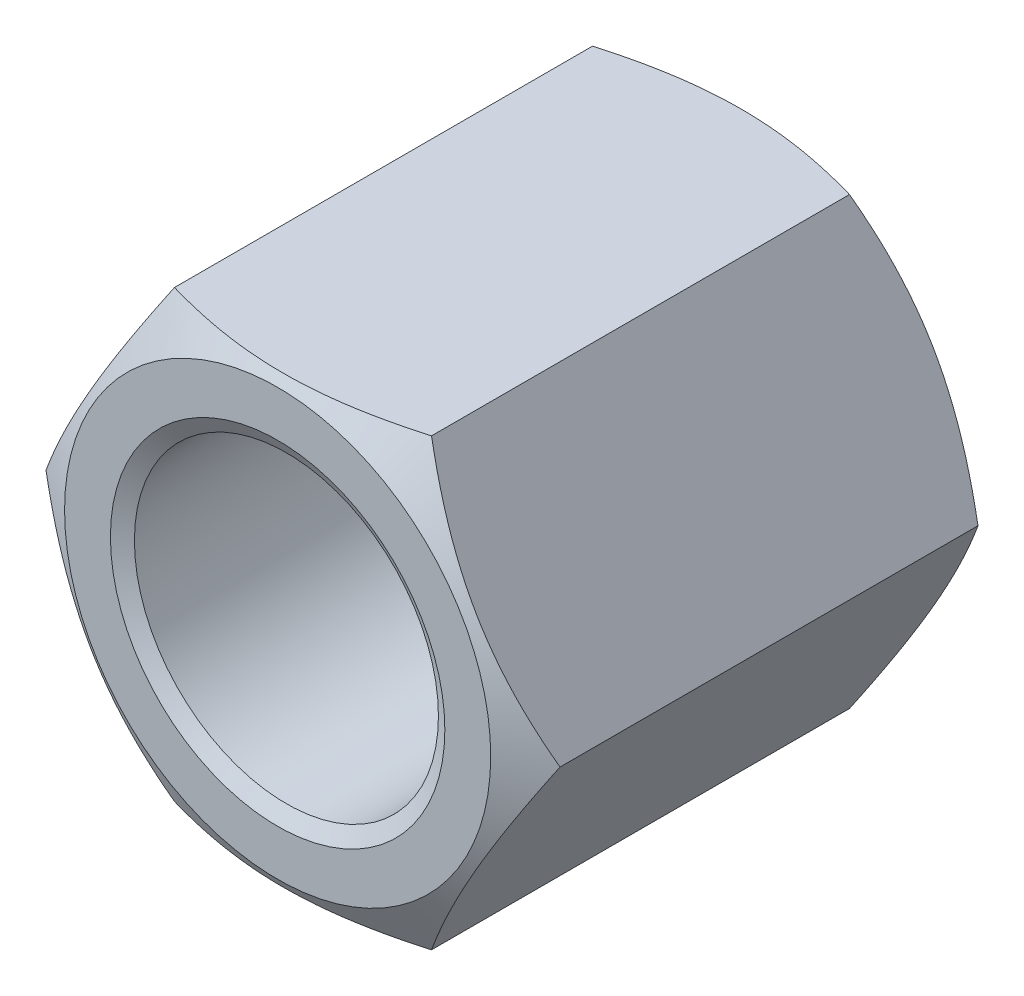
ISO-10303-21;
HEADER;
FILE_DESCRIPTION(('STEP AP214'),'2;1');
FILE_NAME('part.step','',(''),(''),'','','');
FILE_SCHEMA(('AUTOMOTIVE_DESIGN { 1 0 10303 214 1 1 1 1 }'));
ENDSEC;
DATA;
#1=APPLICATION_CONTEXT('core data for automotive mechanical design processes');
#2=APPLICATION_PROTOCOL_DEFINITION('international standard','automotive_design',2000,#1);
#3=PRODUCT_CONTEXT('',#1,'mechanical');
#4=PRODUCT('Part','Part','',(#3));
#5=PRODUCT_RELATED_PRODUCT_CATEGORY('part','',(#4));
#6=PRODUCT_DEFINITION_FORMATION('','',#4);
#7=PRODUCT_DEFINITION_CONTEXT('part definition',#1,'design');
#8=PRODUCT_DEFINITION('design','',#6,#7);
#9=PRODUCT_DEFINITION_SHAPE('','',#8);
#10=(LENGTH_UNIT() NAMED_UNIT(*) SI_UNIT(.MILLI.,.METRE.));
#11=(NAMED_UNIT(*) PLANE_ANGLE_UNIT() SI_UNIT($,.RADIAN.));
#12=(NAMED_UNIT(*) SI_UNIT($,.STERADIAN.) SOLID_ANGLE_UNIT());
#13=UNCERTAINTY_MEASURE_WITH_UNIT(LENGTH_MEASURE(1.E-05),#10,'distance_accuracy_value','');
#14=(GEOMETRIC_REPRESENTATION_CONTEXT(3) GLOBAL_UNCERTAINTY_ASSIGNED_CONTEXT((#13)) GLOBAL_UNIT_ASSIGNED_CONTEXT((#10,
#11,#12)) REPRESENTATION_CONTEXT('',''));
#15=CARTESIAN_POINT('',(0.,0.,0.));
#16=DIRECTION('',(0.,0.,1.));
#17=DIRECTION('',(1.,0.,0.));
#18=AXIS2_PLACEMENT_3D('',#15,#16,#17);
#19=CARTESIAN_POINT('',(-5.07202211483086,-8.785,-18.5));
#20=DIRECTION('',(0.,-1.,0.));
#21=DIRECTION('',(0.,0.,-1.));
#22=AXIS2_PLACEMENT_3D('',#19,#20,#21);
#23=PLANE('',#22);
#24=CARTESIAN_POINT('',(-13.4217436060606,-8.785,-4.40586329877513));
#25=CARTESIAN_POINT('',(-13.2290115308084,-8.785,-4.31276176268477));
#26=CARTESIAN_POINT('',(-13.0360456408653,-8.785,-4.22014448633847));
#27=CARTESIAN_POINT('',(-12.64959683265,-8.785,-4.03598968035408));
#28=CARTESIAN_POINT('',(-12.4561139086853,-8.785,-3.94445216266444));
#29=CARTESIAN_POINT('',(-11.8747583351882,-8.785,-3.67159933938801));
#30=CARTESIAN_POINT('',(-11.4860420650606,-8.785,-3.49207437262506));
#31=CARTESIAN_POINT('',(-10.7036733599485,-8.785,-3.13793005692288));
#32=CARTESIAN_POINT('',(-10.3100053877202,-8.785,-2.96334494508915));
#33=CARTESIAN_POINT('',(-9.51942340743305,-8.785,-2.62171394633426));
#34=CARTESIAN_POINT('',(-9.12250957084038,-8.785,-2.45466766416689));
#35=CARTESIAN_POINT('',(-8.32001606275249,-8.785,-2.12819913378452));
#36=CARTESIAN_POINT('',(-7.91438949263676,-8.785,-1.96889152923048));
#37=CARTESIAN_POINT('',(-7.09834245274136,-8.785,-1.66282803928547));
#38=CARTESIAN_POINT('',(-6.68792145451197,-8.785,-1.51607355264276));
#39=CARTESIAN_POINT('',(-5.86248050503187,-8.785,-1.23908237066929));
#40=CARTESIAN_POINT('',(-5.44747255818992,-8.785,-1.10881029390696));
#41=CARTESIAN_POINT('',(-4.6115731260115,-8.785,-0.86903180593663));
#42=CARTESIAN_POINT('',(-4.19068355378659,-8.785,-0.759518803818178));
#43=CARTESIAN_POINT('',(-3.34265100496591,-8.785,-0.566599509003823));
#44=CARTESIAN_POINT('',(-2.91550602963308,-8.785,-0.483201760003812));
#45=CARTESIAN_POINT('',(-2.27105589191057,-8.785,-0.38188465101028));
#46=CARTESIAN_POINT('',(-2.05559071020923,-8.785,-0.352073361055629));
#47=CARTESIAN_POINT('',(-1.62365980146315,-8.785,-0.300964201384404));
#48=CARTESIAN_POINT('',(-1.40719417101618,-8.785,-0.279665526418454));
#49=CARTESIAN_POINT('',(-0.97491183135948,-8.785,-0.246153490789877));
#50=CARTESIAN_POINT('',(-0.759099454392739,-8.785,-0.233884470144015));
#51=CARTESIAN_POINT('',(-0.327149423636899,-8.785,-0.218496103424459));
#52=CARTESIAN_POINT('',(-0.111011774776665,-8.785,-0.215376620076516));
#53=CARTESIAN_POINT('',(0.321140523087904,-8.785,-0.218361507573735));
#54=CARTESIAN_POINT('',(0.537155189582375,-8.785,-0.224463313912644));
#55=CARTESIAN_POINT('',(0.968740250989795,-8.785,-0.24573987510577));
#56=CARTESIAN_POINT('',(1.18431062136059,-8.785,-0.260915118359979));
#57=CARTESIAN_POINT('',(1.70759461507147,-8.785,-0.308449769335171));
#58=CARTESIAN_POINT('',(2.01489925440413,-8.785,-0.34539998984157));
#59=CARTESIAN_POINT('',(2.62708091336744,-8.785,-0.43567471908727));
#60=CARTESIAN_POINT('',(2.93195756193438,-8.785,-0.489001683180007));
#61=CARTESIAN_POINT('',(3.84348737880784,-8.785,-0.67087087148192));
#62=CARTESIAN_POINT('',(4.44584697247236,-8.785,-0.821179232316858));
#63=CARTESIAN_POINT('',(5.34681739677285,-8.785,-1.08010289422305));
#64=CARTESIAN_POINT('',(5.65014196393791,-8.785,-1.17324449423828));
#65=CARTESIAN_POINT('',(6.25386087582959,-8.785,-1.36875331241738));
#66=CARTESIAN_POINT('',(6.55425495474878,-8.785,-1.4711213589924));
#67=CARTESIAN_POINT('',(7.150613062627,-8.785,-1.68289416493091));
#68=CARTESIAN_POINT('',(7.44659253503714,-8.785,-1.79225587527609));
#69=CARTESIAN_POINT('',(8.03603672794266,-8.785,-2.01727358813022));
#70=CARTESIAN_POINT('',(8.32950228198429,-8.785,-2.13292740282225));
#71=CARTESIAN_POINT('',(8.62191001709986,-8.785,-2.2511373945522));
#72=B_SPLINE_CURVE_WITH_KNOTS('',3,(#24,#25,#26,#27,#28,#29,#30,#31,#32,#33,#34,#35,#36,#37,#38,
#39,#40,#41,#42,#43,#44,#45,#46,#47,#48,#49,#50,#51,#52,#53,#54,#55,#56,#57,#58,#59,#60,#61,#62,
#63,#64,#65,#66,#67,#68,#69,#70,#71),.UNSPECIFIED.,.F.,.F.,(4,2,2,2,2,2,2,2,2,2,2,2,2,2,2,2,2,2,
2,2,2,2,2,4),(0.,0.642121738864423,1.28425057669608,2.56871885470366,3.86059018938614,
5.15239371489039,6.45959889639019,7.76694954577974,9.07144440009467,10.3755243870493,
11.680030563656,12.3324419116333,12.9847915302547,13.6330855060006,14.2813697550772,
14.9294737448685,15.5776126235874,16.5056390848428,17.4338047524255,19.293719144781,
20.2455547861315,21.1974759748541,22.1440160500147,23.0902290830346),.UNSPECIFIED.);
#73=CARTESIAN_POINT('',(-5.07202211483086,-8.785,-1.0011509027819));
#74=VERTEX_POINT('',#73);
#75=CARTESIAN_POINT('',(5.07202211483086,-8.785,-1.0011509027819));
#76=VERTEX_POINT('',#75);
#77=EDGE_CURVE('E50',#74,#76,#72,.T.);
#78=ORIENTED_EDGE('',*,*,#77,.F.);
#79=DIRECTION('',(0.,0.,1.));
#80=VECTOR('',#79,1.);
#81=CARTESIAN_POINT('',(-5.07202211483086,-8.785,-18.5));
#82=LINE('',#81,#80);
#83=CARTESIAN_POINT('',(-5.07202211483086,-8.785,-17.4988490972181));
#84=VERTEX_POINT('',#83);
#85=EDGE_CURVE('E105',#84,#74,#82,.T.);
#86=ORIENTED_EDGE('',*,*,#85,.F.);
#87=CARTESIAN_POINT('',(-13.4217436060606,-8.785,-14.0941367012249));
#88=CARTESIAN_POINT('',(-13.2290115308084,-8.785,-14.1872382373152));
#89=CARTESIAN_POINT('',(-13.0360456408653,-8.785,-14.2798555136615));
#90=CARTESIAN_POINT('',(-12.64959683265,-8.785,-14.4640103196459));
#91=CARTESIAN_POINT('',(-12.4561139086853,-8.785,-14.5555478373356));
#92=CARTESIAN_POINT('',(-11.8747583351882,-8.785,-14.828400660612));
#93=CARTESIAN_POINT('',(-11.4860420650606,-8.785,-15.0079256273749));
#94=CARTESIAN_POINT('',(-10.7036733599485,-8.785,-15.3620699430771));
#95=CARTESIAN_POINT('',(-10.3100053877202,-8.785,-15.5366550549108));
#96=CARTESIAN_POINT('',(-9.51942340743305,-8.785,-15.8782860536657));
#97=CARTESIAN_POINT('',(-9.12250957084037,-8.785,-16.0453323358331));
#98=CARTESIAN_POINT('',(-8.32001606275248,-8.785,-16.3718008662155));
#99=CARTESIAN_POINT('',(-7.91438949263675,-8.785,-16.5311084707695));
#100=CARTESIAN_POINT('',(-7.09834245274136,-8.785,-16.8371719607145));
#101=CARTESIAN_POINT('',(-6.68792145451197,-8.785,-16.9839264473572));
#102=CARTESIAN_POINT('',(-5.86248050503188,-8.785,-17.2609176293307));
#103=CARTESIAN_POINT('',(-5.44747255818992,-8.785,-17.391189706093));
#104=CARTESIAN_POINT('',(-4.6115731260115,-8.785,-17.6309681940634));
#105=CARTESIAN_POINT('',(-4.19068355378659,-8.785,-17.7404811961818));
#106=CARTESIAN_POINT('',(-3.34265100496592,-8.785,-17.9334004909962));
#107=CARTESIAN_POINT('',(-2.91550602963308,-8.785,-18.0167982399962));
#108=CARTESIAN_POINT('',(-2.27105589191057,-8.785,-18.1181153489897));
#109=CARTESIAN_POINT('',(-2.05559071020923,-8.785,-18.1479266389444));
#110=CARTESIAN_POINT('',(-1.62365980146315,-8.785,-18.1990357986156));
#111=CARTESIAN_POINT('',(-1.40719417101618,-8.785,-18.2203344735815));
#112=CARTESIAN_POINT('',(-0.97491183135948,-8.785,-18.2538465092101));
#113=CARTESIAN_POINT('',(-0.759099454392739,-8.785,-18.266115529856));
#114=CARTESIAN_POINT('',(-0.327149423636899,-8.785,-18.2815038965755));
#115=CARTESIAN_POINT('',(-0.111011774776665,-8.785,-18.2846233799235));
#116=CARTESIAN_POINT('',(0.321140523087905,-8.785,-18.2816384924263));
#117=CARTESIAN_POINT('',(0.537155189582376,-8.785,-18.2755366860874));
#118=CARTESIAN_POINT('',(0.968740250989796,-8.785,-18.2542601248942));
#119=CARTESIAN_POINT('',(1.18431062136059,-8.785,-18.23908488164));
#120=CARTESIAN_POINT('',(1.70759461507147,-8.785,-18.1915502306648));
#121=CARTESIAN_POINT('',(2.01489925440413,-8.785,-18.1546000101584));
#122=CARTESIAN_POINT('',(2.62708091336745,-8.785,-18.0643252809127));
#123=CARTESIAN_POINT('',(2.93195756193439,-8.785,-18.01099831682));
#124=CARTESIAN_POINT('',(3.84348737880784,-8.785,-17.8291291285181));
#125=CARTESIAN_POINT('',(4.44584697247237,-8.785,-17.6788207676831));
#126=CARTESIAN_POINT('',(5.34681739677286,-8.785,-17.4198971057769));
#127=CARTESIAN_POINT('',(5.65014196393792,-8.785,-17.3267555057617));
#128=CARTESIAN_POINT('',(6.2538608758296,-8.785,-17.1312466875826));
#129=CARTESIAN_POINT('',(6.55425495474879,-8.785,-17.0288786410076));
#130=CARTESIAN_POINT('',(7.150613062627,-8.785,-16.8171058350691));
#131=CARTESIAN_POINT('',(7.44659253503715,-8.785,-16.7077441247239));
#132=CARTESIAN_POINT('',(8.03603672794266,-8.785,-16.4827264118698));
#133=CARTESIAN_POINT('',(8.3295022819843,-8.785,-16.3670725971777));
#134=CARTESIAN_POINT('',(8.62191001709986,-8.785,-16.2488626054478));
#135=B_SPLINE_CURVE_WITH_KNOTS('',3,(#87,#88,#89,#90,#91,#92,#93,#94,#95,#96,#97,#98,#99,#100,
#101,#102,#103,#104,#105,#106,#107,#108,#109,#110,#111,#112,#113,#114,#115,#116,#117,#118,#119,
#120,#121,#122,#123,#124,#125,#126,#127,#128,#129,#130,#131,#132,#133,#134),.UNSPECIFIED.,.F.,
.F.,(4,2,2,2,2,2,2,2,2,2,2,2,2,2,2,2,2,2,2,2,2,2,2,4),(0.,0.642121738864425,1.28425057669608,
2.56871885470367,3.86059018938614,5.15239371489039,6.4595988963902,7.76694954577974,
9.07144440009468,10.3755243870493,11.680030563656,12.3324419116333,12.9847915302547,
13.6330855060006,14.2813697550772,14.9294737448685,15.5776126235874,16.5056390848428,
17.4338047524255,19.293719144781,20.2455547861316,21.1974759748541,22.1440160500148,
23.0902290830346),.UNSPECIFIED.);
#136=CARTESIAN_POINT('',(5.07202211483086,-8.785,-17.4988490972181));
#137=VERTEX_POINT('',#136);
#138=EDGE_CURVE('E126',#137,#84,#135,.F.);
#139=ORIENTED_EDGE('',*,*,#138,.F.);
#140=DIRECTION('',(0.,0.,1.));
#141=VECTOR('',#140,1.);
#142=CARTESIAN_POINT('',(5.07202211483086,-8.785,-18.5));
#143=LINE('',#142,#141);
#144=EDGE_CURVE('E123',#137,#76,#143,.T.);
#145=ORIENTED_EDGE('',*,*,#144,.T.);
#146=EDGE_LOOP('',(#78,#86,#139,#145));
#147=FACE_BOUND('',#146,.T.);
#148=ADVANCED_FACE('F35',(#147),#23,.T.);
#149=CARTESIAN_POINT('',(-10.1440442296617,0.,-18.5));
#150=DIRECTION('',(-0.866025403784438,-0.5,0.));
#151=DIRECTION('',(0.5,-0.866025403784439,0.));
#152=AXIS2_PLACEMENT_3D('',#149,#150,#151);
#153=PLANE('',#152);
#154=CARTESIAN_POINT('',(-10.1441596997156,0.000200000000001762,-1.00121757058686));
#155=CARTESIAN_POINT('',(-10.0326711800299,-0.192903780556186,-0.936859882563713));
#156=CARTESIAN_POINT('',(-9.92076699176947,-0.386727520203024,-0.875423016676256));
#157=CARTESIAN_POINT('',(-9.69604980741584,-0.775949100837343,-0.759195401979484));
#158=CARTESIAN_POINT('',(-9.58323644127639,-0.97134758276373,-0.704407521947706));
#159=CARTESIAN_POINT('',(-9.24299007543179,-1.56067157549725,-0.551092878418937));
#160=CARTESIAN_POINT('',(-9.01421397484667,-1.95692340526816,-0.463889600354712));
#161=CARTESIAN_POINT('',(-8.67185496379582,-2.54990660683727,-0.361633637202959));
#162=CARTESIAN_POINT('',(-8.55929483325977,-2.74486647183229,-0.332503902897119));
#163=CARTESIAN_POINT('',(-8.33366554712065,-3.13566785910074,-0.2836583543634));
#164=CARTESIAN_POINT('',(-8.22059643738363,-3.33150930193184,-0.263941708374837));
#165=CARTESIAN_POINT('',(-7.99426353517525,-3.72352938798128,-0.234422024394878));
#166=CARTESIAN_POINT('',(-7.88100011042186,-3.91970739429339,-0.224607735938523));
#167=CARTESIAN_POINT('',(-7.65436863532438,-4.31224462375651,-0.215103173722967));
#168=CARTESIAN_POINT('',(-7.54100058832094,-4.50860384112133,-0.21541258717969));
#169=CARTESIAN_POINT('',(-7.32905549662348,-4.87570350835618,-0.225451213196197));
#170=CARTESIAN_POINT('',(-7.23046349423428,-5.04646986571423,-0.233955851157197));
#171=CARTESIAN_POINT('',(-7.03351040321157,-5.38760262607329,-0.258456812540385));
#172=CARTESIAN_POINT('',(-6.93514933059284,-5.5579690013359,-0.274453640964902));
#173=CARTESIAN_POINT('',(-6.64044690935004,-6.068408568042,-0.333304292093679));
#174=CARTESIAN_POINT('',(-6.44462720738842,-6.40757824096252,-0.387010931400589));
#175=CARTESIAN_POINT('',(-6.05091060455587,-7.08951540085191,-0.521278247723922));
#176=CARTESIAN_POINT('',(-5.8530639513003,-7.43219585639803,-0.602408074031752));
#177=CARTESIAN_POINT('',(-5.46032103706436,-8.11244653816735,-0.786539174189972));
#178=CARTESIAN_POINT('',(-5.26541974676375,-8.45002547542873,-0.889497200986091));
#179=CARTESIAN_POINT('',(-5.07190664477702,-8.78519999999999,-1.00121757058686));
#180=B_SPLINE_CURVE_WITH_KNOTS('',3,(#154,#155,#156,#157,#158,#159,#160,#161,#162,#163,#164,
#165,#166,#167,#168,#169,#170,#171,#172,#173,#174,#175,#176,#177,#178,#179),.UNSPECIFIED.,.F.,
.F.,(4,2,2,2,2,2,2,2,2,2,2,2,4),(0.,0.696181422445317,1.39266216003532,2.78851741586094,
3.4693501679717,4.15012274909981,4.83012100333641,5.5100982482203,6.10205267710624,
6.69404701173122,7.87887893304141,9.08998790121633,10.2987194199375),.UNSPECIFIED.);
#181=CARTESIAN_POINT('',(-10.1440442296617,0.,-1.0011509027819));
#182=VERTEX_POINT('',#181);
#183=EDGE_CURVE('E90',#182,#74,#180,.T.);
#184=ORIENTED_EDGE('',*,*,#183,.F.);
#185=DIRECTION('',(0.,0.,1.));
#186=VECTOR('',#185,1.);
#187=CARTESIAN_POINT('',(-10.1440442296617,0.,-18.5));
#188=LINE('',#187,#186);
#189=CARTESIAN_POINT('',(-10.1440442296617,0.,-17.4988490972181));
#190=VERTEX_POINT('',#189);
#191=EDGE_CURVE('E103',#190,#182,#188,.T.);
#192=ORIENTED_EDGE('',*,*,#191,.F.);
#193=CARTESIAN_POINT('',(-5.07190664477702,-8.7852,-17.4987824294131));
#194=CARTESIAN_POINT('',(-5.18339516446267,-8.59209621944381,-17.5631401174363));
#195=CARTESIAN_POINT('',(-5.29529935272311,-8.39827247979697,-17.6245769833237));
#196=CARTESIAN_POINT('',(-5.52001653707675,-8.00905089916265,-17.7408045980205));
#197=CARTESIAN_POINT('',(-5.63282990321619,-7.81365241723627,-17.7955924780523));
#198=CARTESIAN_POINT('',(-5.97307626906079,-7.22432842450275,-17.9489071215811));
#199=CARTESIAN_POINT('',(-6.20185236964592,-6.82807659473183,-18.0361103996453));
#200=CARTESIAN_POINT('',(-6.54421138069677,-6.23509339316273,-18.138366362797));
#201=CARTESIAN_POINT('',(-6.65677151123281,-6.04013352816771,-18.1674960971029));
#202=CARTESIAN_POINT('',(-6.88240079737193,-5.64933214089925,-18.2163416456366));
#203=CARTESIAN_POINT('',(-6.99546990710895,-5.45349069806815,-18.2360582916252));
#204=CARTESIAN_POINT('',(-7.22180280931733,-5.06147061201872,-18.2655779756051));
#205=CARTESIAN_POINT('',(-7.33506623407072,-4.8652926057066,-18.2753922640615));
#206=CARTESIAN_POINT('',(-7.5616977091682,-4.47275537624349,-18.284896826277));
#207=CARTESIAN_POINT('',(-7.67506575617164,-4.27639615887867,-18.2845874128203));
#208=CARTESIAN_POINT('',(-7.88701084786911,-3.90929649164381,-18.2745487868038));
#209=CARTESIAN_POINT('',(-7.98560285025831,-3.73853013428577,-18.2660441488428));
#210=CARTESIAN_POINT('',(-8.18255594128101,-3.39739737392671,-18.2415431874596));
#211=CARTESIAN_POINT('',(-8.28091701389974,-3.22703099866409,-18.2255463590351));
#212=CARTESIAN_POINT('',(-8.57561943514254,-2.716591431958,-18.1666957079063));
#213=CARTESIAN_POINT('',(-8.77143913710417,-2.37742175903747,-18.1129890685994));
#214=CARTESIAN_POINT('',(-9.16515573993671,-1.69548459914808,-17.9787217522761));
#215=CARTESIAN_POINT('',(-9.36300239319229,-1.35280414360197,-17.8975919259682));
#216=CARTESIAN_POINT('',(-9.75574530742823,-0.672553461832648,-17.71346082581));
#217=CARTESIAN_POINT('',(-9.95064659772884,-0.334974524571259,-17.6105027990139));
#218=CARTESIAN_POINT('',(-10.1441596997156,0.000200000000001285,-17.4987824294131));
#219=B_SPLINE_CURVE_WITH_KNOTS('',3,(#193,#194,#195,#196,#197,#198,#199,#200,#201,#202,#203,
#204,#205,#206,#207,#208,#209,#210,#211,#212,#213,#214,#215,#216,#217,#218),.UNSPECIFIED.,.F.,
.F.,(4,2,2,2,2,2,2,2,2,2,2,2,4),(0.,0.696181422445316,1.39266216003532,2.78851741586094,
3.4693501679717,4.15012274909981,4.83012100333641,5.5100982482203,6.10205267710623,
6.69404701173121,7.87887893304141,9.08998790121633,10.2987194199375),.UNSPECIFIED.);
#220=EDGE_CURVE('E207',#84,#190,#219,.T.);
#221=ORIENTED_EDGE('',*,*,#220,.F.);
#222=ORIENTED_EDGE('',*,*,#85,.T.);
#223=EDGE_LOOP('',(#184,#192,#221,#222));
#224=FACE_BOUND('',#223,.T.);
#225=ADVANCED_FACE('F101',(#224),#153,.T.);
#226=CARTESIAN_POINT('',(-5.07202211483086,8.785,-18.5));
#227=DIRECTION('',(-0.866025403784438,0.5,0.));
#228=DIRECTION('',(-0.5,-0.866025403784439,0.));
#229=AXIS2_PLACEMENT_3D('',#226,#227,#228);
#230=PLANE('',#229);
#231=CARTESIAN_POINT('',(-5.07190664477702,8.7852,-1.00121757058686));
#232=CARTESIAN_POINT('',(-5.18339516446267,8.59209621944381,-0.936859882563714));
#233=CARTESIAN_POINT('',(-5.29529935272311,8.39827247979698,-0.875423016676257));
#234=CARTESIAN_POINT('',(-5.52001653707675,8.00905089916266,-0.759195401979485));
#235=CARTESIAN_POINT('',(-5.63282990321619,7.81365241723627,-0.704407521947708));
#236=CARTESIAN_POINT('',(-5.97307626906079,7.22432842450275,-0.551092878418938));
#237=CARTESIAN_POINT('',(-6.20185236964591,6.82807659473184,-0.463889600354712));
#238=CARTESIAN_POINT('',(-6.54421138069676,6.23509339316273,-0.36163363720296));
#239=CARTESIAN_POINT('',(-6.65677151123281,6.04013352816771,-0.332503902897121));
#240=CARTESIAN_POINT('',(-6.88240079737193,5.64933214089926,-0.283658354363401));
#241=CARTESIAN_POINT('',(-6.99546990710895,5.45349069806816,-0.263941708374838));
#242=CARTESIAN_POINT('',(-7.22180280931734,5.06147061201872,-0.234422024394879));
#243=CARTESIAN_POINT('',(-7.33506623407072,4.86529260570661,-0.224607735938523));
#244=CARTESIAN_POINT('',(-7.5616977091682,4.47275537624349,-0.215103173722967));
#245=CARTESIAN_POINT('',(-7.67506575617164,4.27639615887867,-0.215412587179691));
#246=CARTESIAN_POINT('',(-7.88701084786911,3.90929649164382,-0.225451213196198));
#247=CARTESIAN_POINT('',(-7.98560285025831,3.73853013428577,-0.233955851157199));
#248=CARTESIAN_POINT('',(-8.18255594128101,3.39739737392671,-0.258456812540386));
#249=CARTESIAN_POINT('',(-8.28091701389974,3.2270309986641,-0.274453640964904));
#250=CARTESIAN_POINT('',(-8.57561943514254,2.716591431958,-0.33330429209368));
#251=CARTESIAN_POINT('',(-8.77143913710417,2.37742175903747,-0.38701093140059));
#252=CARTESIAN_POINT('',(-9.16515573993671,1.69548459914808,-0.521278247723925));
#253=CARTESIAN_POINT('',(-9.36300239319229,1.35280414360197,-0.602408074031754));
#254=CARTESIAN_POINT('',(-9.75574530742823,0.67255346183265,-0.786539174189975));
#255=CARTESIAN_POINT('',(-9.95064659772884,0.334974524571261,-0.889497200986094));
#256=CARTESIAN_POINT('',(-10.1441596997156,-0.000199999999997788,-1.00121757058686));
#257=B_SPLINE_CURVE_WITH_KNOTS('',3,(#231,#232,#233,#234,#235,#236,#237,#238,#239,#240,#241,
#242,#243,#244,#245,#246,#247,#248,#249,#250,#251,#252,#253,#254,#255,#256),.UNSPECIFIED.,.F.,
.F.,(4,2,2,2,2,2,2,2,2,2,2,2,4),(0.,0.696181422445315,1.39266216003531,2.78851741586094,
3.4693501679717,4.15012274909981,4.83012100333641,5.5100982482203,6.10205267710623,
6.69404701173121,7.87887893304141,9.08998790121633,10.2987194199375),.UNSPECIFIED.);
#258=CARTESIAN_POINT('',(-5.07202211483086,8.785,-1.0011509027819));
#259=VERTEX_POINT('',#258);
#260=EDGE_CURVE('E86',#259,#182,#257,.T.);
#261=ORIENTED_EDGE('',*,*,#260,.F.);
#262=DIRECTION('',(0.,0.,1.));
#263=VECTOR('',#262,1.);
#264=CARTESIAN_POINT('',(-5.07202211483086,8.785,-18.5));
#265=LINE('',#264,#263);
#266=CARTESIAN_POINT('',(-5.07202211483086,8.785,-17.4988490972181));
#267=VERTEX_POINT('',#266);
#268=EDGE_CURVE('E110',#267,#259,#265,.T.);
#269=ORIENTED_EDGE('',*,*,#268,.F.);
#270=CARTESIAN_POINT('',(-10.1441596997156,-0.000199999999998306,-17.4987824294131));
#271=CARTESIAN_POINT('',(-10.0326711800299,0.19290378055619,-17.5631401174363));
#272=CARTESIAN_POINT('',(-9.92076699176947,0.386727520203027,-17.6245769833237));
#273=CARTESIAN_POINT('',(-9.69604980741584,0.775949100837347,-17.7408045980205));
#274=CARTESIAN_POINT('',(-9.58323644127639,0.971347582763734,-17.7955924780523));
#275=CARTESIAN_POINT('',(-9.24299007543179,1.56067157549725,-17.9489071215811));
#276=CARTESIAN_POINT('',(-9.01421397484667,1.95692340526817,-18.0361103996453));
#277=CARTESIAN_POINT('',(-8.67185496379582,2.54990660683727,-18.138366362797));
#278=CARTESIAN_POINT('',(-8.55929483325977,2.74486647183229,-18.1674960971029));
#279=CARTESIAN_POINT('',(-8.33366554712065,3.13566785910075,-18.2163416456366));
#280=CARTESIAN_POINT('',(-8.22059643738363,3.33150930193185,-18.2360582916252));
#281=CARTESIAN_POINT('',(-7.99426353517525,3.72352938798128,-18.2655779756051));
#282=CARTESIAN_POINT('',(-7.88100011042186,3.9197073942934,-18.2753922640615));
#283=CARTESIAN_POINT('',(-7.65436863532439,4.31224462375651,-18.284896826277));
#284=CARTESIAN_POINT('',(-7.54100058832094,4.50860384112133,-18.2845874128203));
#285=CARTESIAN_POINT('',(-7.32905549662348,4.87570350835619,-18.2745487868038));
#286=CARTESIAN_POINT('',(-7.23046349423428,5.04646986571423,-18.2660441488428));
#287=CARTESIAN_POINT('',(-7.03351040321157,5.38760262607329,-18.2415431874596));
#288=CARTESIAN_POINT('',(-6.93514933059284,5.55796900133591,-18.2255463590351));
#289=CARTESIAN_POINT('',(-6.64044690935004,6.06840856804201,-18.1666957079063));
#290=CARTESIAN_POINT('',(-6.44462720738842,6.40757824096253,-18.1129890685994));
#291=CARTESIAN_POINT('',(-6.05091060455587,7.08951540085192,-17.9787217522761));
#292=CARTESIAN_POINT('',(-5.8530639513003,7.43219585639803,-17.8975919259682));
#293=CARTESIAN_POINT('',(-5.46032103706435,8.11244653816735,-17.71346082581));
#294=CARTESIAN_POINT('',(-5.26541974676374,8.45002547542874,-17.6105027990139));
#295=CARTESIAN_POINT('',(-5.07190664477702,8.7852,-17.4987824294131));
#296=B_SPLINE_CURVE_WITH_KNOTS('',3,(#270,#271,#272,#273,#274,#275,#276,#277,#278,#279,#280,
#281,#282,#283,#284,#285,#286,#287,#288,#289,#290,#291,#292,#293,#294,#295),.UNSPECIFIED.,.F.,
.F.,(4,2,2,2,2,2,2,2,2,2,2,2,4),(0.,0.696181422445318,1.39266216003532,2.78851741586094,
3.4693501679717,4.15012274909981,4.83012100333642,5.5100982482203,6.10205267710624,
6.69404701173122,7.87887893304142,9.08998790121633,10.2987194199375),.UNSPECIFIED.);
#297=EDGE_CURVE('E109',#190,#267,#296,.T.);
#298=ORIENTED_EDGE('',*,*,#297,.F.);
#299=ORIENTED_EDGE('',*,*,#191,.T.);
#300=EDGE_LOOP('',(#261,#269,#298,#299));
#301=FACE_BOUND('',#300,.T.);
#302=ADVANCED_FACE('F108',(#301),#230,.T.);
#303=CARTESIAN_POINT('',(5.07202211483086,8.785,-18.5));
#304=DIRECTION('',(0.,1.,0.));
#305=DIRECTION('',(0.,0.,1.));
#306=AXIS2_PLACEMENT_3D('',#303,#304,#305);
#307=PLANE('',#306);
#308=CARTESIAN_POINT('',(-13.4217436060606,8.785,-4.40586329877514));
#309=CARTESIAN_POINT('',(-13.2290115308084,8.785,-4.31276176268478));
#310=CARTESIAN_POINT('',(-13.0360456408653,8.785,-4.22014448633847));
#311=CARTESIAN_POINT('',(-12.64959683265,8.785,-4.03598968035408));
#312=CARTESIAN_POINT('',(-12.4561139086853,8.785,-3.94445216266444));
#313=CARTESIAN_POINT('',(-11.8747583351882,8.785,-3.67159933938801));
#314=CARTESIAN_POINT('',(-11.4860420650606,8.785,-3.49207437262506));
#315=CARTESIAN_POINT('',(-10.7036733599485,8.785,-3.13793005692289));
#316=CARTESIAN_POINT('',(-10.3100053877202,8.785,-2.96334494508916));
#317=CARTESIAN_POINT('',(-9.51942340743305,8.785,-2.62171394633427));
#318=CARTESIAN_POINT('',(-9.12250957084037,8.785,-2.45466766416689));
#319=CARTESIAN_POINT('',(-8.32001606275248,8.785,-2.12819913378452));
#320=CARTESIAN_POINT('',(-7.91438949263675,8.785,-1.96889152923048));
#321=CARTESIAN_POINT('',(-7.09834245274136,8.785,-1.66282803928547));
#322=CARTESIAN_POINT('',(-6.68792145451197,8.785,-1.51607355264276));
#323=CARTESIAN_POINT('',(-5.86248050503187,8.785,-1.23908237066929));
#324=CARTESIAN_POINT('',(-5.44747255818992,8.785,-1.10881029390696));
#325=CARTESIAN_POINT('',(-4.61157312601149,8.785,-0.869031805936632));
#326=CARTESIAN_POINT('',(-4.19068355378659,8.785,-0.75951880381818));
#327=CARTESIAN_POINT('',(-3.34265100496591,8.785,-0.566599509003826));
#328=CARTESIAN_POINT('',(-2.91550602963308,8.785,-0.483201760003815));
#329=CARTESIAN_POINT('',(-2.27105589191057,8.785,-0.381884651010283));
#330=CARTESIAN_POINT('',(-2.05559071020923,8.785,-0.352073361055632));
#331=CARTESIAN_POINT('',(-1.62365980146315,8.785,-0.300964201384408));
#332=CARTESIAN_POINT('',(-1.40719417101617,8.785,-0.279665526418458));
#333=CARTESIAN_POINT('',(-0.974911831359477,8.785,-0.246153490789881));
#334=CARTESIAN_POINT('',(-0.759099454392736,8.785,-0.233884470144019));
#335=CARTESIAN_POINT('',(-0.327149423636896,8.785,-0.218496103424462));
#336=CARTESIAN_POINT('',(-0.111011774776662,8.785,-0.215376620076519));
#337=CARTESIAN_POINT('',(0.321140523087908,8.785,-0.218361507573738));
#338=CARTESIAN_POINT('',(0.53715518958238,8.785,-0.224463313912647));
#339=CARTESIAN_POINT('',(0.968740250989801,8.785,-0.245739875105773));
#340=CARTESIAN_POINT('',(1.1843106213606,8.785,-0.260915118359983));
#341=CARTESIAN_POINT('',(1.70759461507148,8.785,-0.308449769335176));
#342=CARTESIAN_POINT('',(2.01489925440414,8.785,-0.345399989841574));
#343=CARTESIAN_POINT('',(2.62708091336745,8.785,-0.435674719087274));
#344=CARTESIAN_POINT('',(2.93195756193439,8.785,-0.489001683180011));
#345=CARTESIAN_POINT('',(3.84348737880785,8.785,-0.670870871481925));
#346=CARTESIAN_POINT('',(4.44584697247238,8.785,-0.821179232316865));
#347=CARTESIAN_POINT('',(5.34681739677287,8.785,-1.08010289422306));
#348=CARTESIAN_POINT('',(5.65014196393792,8.785,-1.17324449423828));
#349=CARTESIAN_POINT('',(6.25386087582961,8.785,-1.36875331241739));
#350=CARTESIAN_POINT('',(6.5542549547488,8.785,-1.47112135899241));
#351=CARTESIAN_POINT('',(7.15061306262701,8.785,-1.68289416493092));
#352=CARTESIAN_POINT('',(7.44659253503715,8.785,-1.7922558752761));
#353=CARTESIAN_POINT('',(8.03603672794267,8.785,-2.01727358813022));
#354=CARTESIAN_POINT('',(8.32950228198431,8.785,-2.13292740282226));
#355=CARTESIAN_POINT('',(8.62191001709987,8.785,-2.2511373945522));
#356=B_SPLINE_CURVE_WITH_KNOTS('',3,(#308,#309,#310,#311,#312,#313,#314,#315,#316,#317,#318,
#319,#320,#321,#322,#323,#324,#325,#326,#327,#328,#329,#330,#331,#332,#333,#334,#335,#336,#337,
#338,#339,#340,#341,#342,#343,#344,#345,#346,#347,#348,#349,#350,#351,#352,#353,#354,#355),
.UNSPECIFIED.,.F.,.F.,(4,2,2,2,2,2,2,2,2,2,2,2,2,2,2,2,2,2,2,2,2,2,2,4),(0.,0.642121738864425,
1.28425057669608,2.56871885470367,3.86059018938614,5.15239371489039,6.4595988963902,
7.76694954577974,9.07144440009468,10.3755243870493,11.680030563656,12.3324419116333,
12.9847915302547,13.6330855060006,14.2813697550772,14.9294737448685,15.5776126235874,
16.5056390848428,17.4338047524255,19.293719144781,20.2455547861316,21.1974759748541,
22.1440160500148,23.0902290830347),.UNSPECIFIED.);
#357=CARTESIAN_POINT('',(5.07202211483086,8.785,-1.0011509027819));
#358=VERTEX_POINT('',#357);
#359=EDGE_CURVE('E92',#358,#259,#356,.F.);
#360=ORIENTED_EDGE('',*,*,#359,.F.);
#361=DIRECTION('',(0.,0.,1.));
#362=VECTOR('',#361,1.);
#363=CARTESIAN_POINT('',(5.07202211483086,8.785,-18.5));
#364=LINE('',#363,#362);
#365=CARTESIAN_POINT('',(5.07202211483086,8.785,-17.4988490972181));
#366=VERTEX_POINT('',#365);
#367=EDGE_CURVE('E114',#366,#358,#364,.T.);
#368=ORIENTED_EDGE('',*,*,#367,.F.);
#369=CARTESIAN_POINT('',(-13.4217436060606,8.785,-14.0941367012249));
#370=CARTESIAN_POINT('',(-13.2290115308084,8.785,-14.1872382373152));
#371=CARTESIAN_POINT('',(-13.0360456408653,8.785,-14.2798555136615));
#372=CARTESIAN_POINT('',(-12.64959683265,8.785,-14.4640103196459));
#373=CARTESIAN_POINT('',(-12.4561139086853,8.785,-14.5555478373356));
#374=CARTESIAN_POINT('',(-11.8747583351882,8.785,-14.828400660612));
#375=CARTESIAN_POINT('',(-11.4860420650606,8.785,-15.0079256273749));
#376=CARTESIAN_POINT('',(-10.7036733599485,8.785,-15.3620699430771));
#377=CARTESIAN_POINT('',(-10.3100053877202,8.785,-15.5366550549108));
#378=CARTESIAN_POINT('',(-9.51942340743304,8.785,-15.8782860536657));
#379=CARTESIAN_POINT('',(-9.12250957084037,8.785,-16.0453323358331));
#380=CARTESIAN_POINT('',(-8.32001606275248,8.785,-16.3718008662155));
#381=CARTESIAN_POINT('',(-7.91438949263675,8.785,-16.5311084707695));
#382=CARTESIAN_POINT('',(-7.09834245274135,8.785,-16.8371719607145));
#383=CARTESIAN_POINT('',(-6.68792145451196,8.785,-16.9839264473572));
#384=CARTESIAN_POINT('',(-5.86248050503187,8.785,-17.2609176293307));
#385=CARTESIAN_POINT('',(-5.44747255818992,8.785,-17.391189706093));
#386=CARTESIAN_POINT('',(-4.61157312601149,8.785,-17.6309681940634));
#387=CARTESIAN_POINT('',(-4.19068355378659,8.785,-17.7404811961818));
#388=CARTESIAN_POINT('',(-3.34265100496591,8.785,-17.9334004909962));
#389=CARTESIAN_POINT('',(-2.91550602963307,8.785,-18.0167982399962));
#390=CARTESIAN_POINT('',(-2.27105589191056,8.785,-18.1181153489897));
#391=CARTESIAN_POINT('',(-2.05559071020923,8.785,-18.1479266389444));
#392=CARTESIAN_POINT('',(-1.62365980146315,8.785,-18.1990357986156));
#393=CARTESIAN_POINT('',(-1.40719417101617,8.785,-18.2203344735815));
#394=CARTESIAN_POINT('',(-0.974911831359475,8.785,-18.2538465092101));
#395=CARTESIAN_POINT('',(-0.759099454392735,8.785,-18.266115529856));
#396=CARTESIAN_POINT('',(-0.327149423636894,8.785,-18.2815038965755));
#397=CARTESIAN_POINT('',(-0.111011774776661,8.785,-18.2846233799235));
#398=CARTESIAN_POINT('',(0.321140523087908,8.785,-18.2816384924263));
#399=CARTESIAN_POINT('',(0.53715518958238,8.785,-18.2755366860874));
#400=CARTESIAN_POINT('',(0.9687402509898,8.785,-18.2542601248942));
#401=CARTESIAN_POINT('',(1.18431062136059,8.785,-18.23908488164));
#402=CARTESIAN_POINT('',(1.70759461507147,8.785,-18.1915502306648));
#403=CARTESIAN_POINT('',(2.01489925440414,8.785,-18.1546000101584));
#404=CARTESIAN_POINT('',(2.62708091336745,8.785,-18.0643252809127));
#405=CARTESIAN_POINT('',(2.93195756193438,8.785,-18.01099831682));
#406=CARTESIAN_POINT('',(3.84348737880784,8.785,-17.8291291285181));
#407=CARTESIAN_POINT('',(4.44584697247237,8.785,-17.6788207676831));
#408=CARTESIAN_POINT('',(5.34681739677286,8.785,-17.4198971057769));
#409=CARTESIAN_POINT('',(5.65014196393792,8.785,-17.3267555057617));
#410=CARTESIAN_POINT('',(6.2538608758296,8.785,-17.1312466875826));
#411=CARTESIAN_POINT('',(6.55425495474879,8.785,-17.0288786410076));
#412=CARTESIAN_POINT('',(7.15061306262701,8.785,-16.8171058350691));
#413=CARTESIAN_POINT('',(7.44659253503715,8.785,-16.7077441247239));
#414=CARTESIAN_POINT('',(8.03603672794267,8.785,-16.4827264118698));
#415=CARTESIAN_POINT('',(8.3295022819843,8.785,-16.3670725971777));
#416=CARTESIAN_POINT('',(8.62191001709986,8.785,-16.2488626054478));
#417=B_SPLINE_CURVE_WITH_KNOTS('',3,(#369,#370,#371,#372,#373,#374,#375,#376,#377,#378,#379,
#380,#381,#382,#383,#384,#385,#386,#387,#388,#389,#390,#391,#392,#393,#394,#395,#396,#397,#398,
#399,#400,#401,#402,#403,#404,#405,#406,#407,#408,#409,#410,#411,#412,#413,#414,#415,#416),
.UNSPECIFIED.,.F.,.F.,(4,2,2,2,2,2,2,2,2,2,2,2,2,2,2,2,2,2,2,2,2,2,2,4),(0.,0.642121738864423,
1.28425057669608,2.56871885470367,3.86059018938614,5.15239371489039,6.4595988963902,
7.76694954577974,9.07144440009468,10.3755243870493,11.680030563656,12.3324419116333,
12.9847915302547,13.6330855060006,14.2813697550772,14.9294737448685,15.5776126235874,
16.5056390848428,17.4338047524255,19.293719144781,20.2455547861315,21.1974759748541,
22.1440160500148,23.0902290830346),.UNSPECIFIED.);
#418=EDGE_CURVE('E194',#267,#366,#417,.T.);
#419=ORIENTED_EDGE('',*,*,#418,.F.);
#420=ORIENTED_EDGE('',*,*,#268,.T.);
#421=EDGE_LOOP('',(#360,#368,#419,#420));
#422=FACE_BOUND('',#421,.T.);
#423=ADVANCED_FACE('F242',(#422),#307,.T.);
#424=CARTESIAN_POINT('',(10.1440442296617,0.,-18.5));
#425=DIRECTION('',(0.866025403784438,0.5,0.));
#426=DIRECTION('',(-0.5,0.866025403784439,0.));
#427=AXIS2_PLACEMENT_3D('',#424,#425,#426);
#428=PLANE('',#427);
#429=CARTESIAN_POINT('',(10.1441596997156,-0.000199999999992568,-1.00121757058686));
#430=CARTESIAN_POINT('',(10.0326711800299,0.192903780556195,-0.936859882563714));
#431=CARTESIAN_POINT('',(9.92076699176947,0.386727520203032,-0.875423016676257));
#432=CARTESIAN_POINT('',(9.69604980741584,0.77594910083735,-0.759195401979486));
#433=CARTESIAN_POINT('',(9.58323644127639,0.971347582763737,-0.704407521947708));
#434=CARTESIAN_POINT('',(9.24299007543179,1.56067157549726,-0.551092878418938));
#435=CARTESIAN_POINT('',(9.01421397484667,1.95692340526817,-0.463889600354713));
#436=CARTESIAN_POINT('',(8.67185496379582,2.54990660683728,-0.36163363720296));
#437=CARTESIAN_POINT('',(8.55929483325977,2.74486647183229,-0.33250390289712));
#438=CARTESIAN_POINT('',(8.33366554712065,3.13566785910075,-0.283658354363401));
#439=CARTESIAN_POINT('',(8.22059643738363,3.33150930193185,-0.263941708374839));
#440=CARTESIAN_POINT('',(7.99426353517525,3.72352938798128,-0.23442202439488));
#441=CARTESIAN_POINT('',(7.88100011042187,3.9197073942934,-0.224607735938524));
#442=CARTESIAN_POINT('',(7.65436863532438,4.31224462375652,-0.215103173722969));
#443=CARTESIAN_POINT('',(7.54100058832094,4.50860384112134,-0.215412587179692));
#444=CARTESIAN_POINT('',(7.32905549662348,4.87570350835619,-0.225451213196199));
#445=CARTESIAN_POINT('',(7.23046349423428,5.04646986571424,-0.233955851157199));
#446=CARTESIAN_POINT('',(7.03351040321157,5.38760262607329,-0.258456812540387));
#447=CARTESIAN_POINT('',(6.93514933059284,5.55796900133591,-0.274453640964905));
#448=CARTESIAN_POINT('',(6.64044690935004,6.06840856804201,-0.333304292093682));
#449=CARTESIAN_POINT('',(6.44462720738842,6.40757824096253,-0.387010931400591));
#450=CARTESIAN_POINT('',(6.05091060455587,7.08951540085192,-0.521278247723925));
#451=CARTESIAN_POINT('',(5.8530639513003,7.43219585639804,-0.602408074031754));
#452=CARTESIAN_POINT('',(5.46032103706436,8.11244653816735,-0.786539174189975));
#453=CARTESIAN_POINT('',(5.26541974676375,8.45002547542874,-0.889497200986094));
#454=CARTESIAN_POINT('',(5.07190664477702,8.7852,-1.00121757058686));
#455=B_SPLINE_CURVE_WITH_KNOTS('',3,(#429,#430,#431,#432,#433,#434,#435,#436,#437,#438,#439,
#440,#441,#442,#443,#444,#445,#446,#447,#448,#449,#450,#451,#452,#453,#454),.UNSPECIFIED.,.F.,
.F.,(4,2,2,2,2,2,2,2,2,2,2,2,4),(0.,0.696181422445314,1.39266216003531,2.78851741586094,
3.4693501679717,4.15012274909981,4.83012100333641,5.5100982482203,6.10205267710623,
6.69404701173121,7.87887893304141,9.08998790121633,10.2987194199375),.UNSPECIFIED.);
#456=CARTESIAN_POINT('',(10.1440442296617,0.,-1.0011509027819));
#457=VERTEX_POINT('',#456);
#458=EDGE_CURVE('E236',#457,#358,#455,.T.);
#459=ORIENTED_EDGE('',*,*,#458,.F.);
#460=DIRECTION('',(0.,0.,1.));
#461=VECTOR('',#460,1.);
#462=CARTESIAN_POINT('',(10.1440442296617,0.,-18.5));
#463=LINE('',#462,#461);
#464=CARTESIAN_POINT('',(10.1440442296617,0.,-17.4988490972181));
#465=VERTEX_POINT('',#464);
#466=EDGE_CURVE('E120',#465,#457,#463,.T.);
#467=ORIENTED_EDGE('',*,*,#466,.F.);
#468=CARTESIAN_POINT('',(5.07190664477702,8.7852,-17.4987824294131));
#469=CARTESIAN_POINT('',(5.18339516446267,8.59209621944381,-17.5631401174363));
#470=CARTESIAN_POINT('',(5.29529935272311,8.39827247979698,-17.6245769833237));
#471=CARTESIAN_POINT('',(5.52001653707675,8.00905089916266,-17.7408045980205));
#472=CARTESIAN_POINT('',(5.63282990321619,7.81365241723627,-17.7955924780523));
#473=CARTESIAN_POINT('',(5.9730762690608,7.22432842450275,-17.9489071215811));
#474=CARTESIAN_POINT('',(6.20185236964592,6.82807659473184,-18.0361103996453));
#475=CARTESIAN_POINT('',(6.54421138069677,6.23509339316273,-18.138366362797));
#476=CARTESIAN_POINT('',(6.65677151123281,6.04013352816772,-18.1674960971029));
#477=CARTESIAN_POINT('',(6.88240079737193,5.64933214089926,-18.2163416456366));
#478=CARTESIAN_POINT('',(6.99546990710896,5.45349069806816,-18.2360582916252));
#479=CARTESIAN_POINT('',(7.22180280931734,5.06147061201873,-18.2655779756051));
#480=CARTESIAN_POINT('',(7.33506623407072,4.86529260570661,-18.2753922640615));
#481=CARTESIAN_POINT('',(7.5616977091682,4.47275537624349,-18.284896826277));
#482=CARTESIAN_POINT('',(7.67506575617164,4.27639615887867,-18.2845874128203));
#483=CARTESIAN_POINT('',(7.88701084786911,3.90929649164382,-18.2745487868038));
#484=CARTESIAN_POINT('',(7.98560285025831,3.73853013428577,-18.2660441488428));
#485=CARTESIAN_POINT('',(8.18255594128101,3.39739737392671,-18.2415431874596));
#486=CARTESIAN_POINT('',(8.28091701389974,3.2270309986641,-18.2255463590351));
#487=CARTESIAN_POINT('',(8.57561943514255,2.716591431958,-18.1666957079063));
#488=CARTESIAN_POINT('',(8.77143913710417,2.37742175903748,-18.1129890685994));
#489=CARTESIAN_POINT('',(9.16515573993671,1.69548459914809,-17.9787217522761));
#490=CARTESIAN_POINT('',(9.36300239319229,1.35280414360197,-17.8975919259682));
#491=CARTESIAN_POINT('',(9.75574530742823,0.672553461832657,-17.71346082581));
#492=CARTESIAN_POINT('',(9.95064659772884,0.334974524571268,-17.6105027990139));
#493=CARTESIAN_POINT('',(10.1441596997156,-0.000199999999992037,-17.4987824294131));
#494=B_SPLINE_CURVE_WITH_KNOTS('',3,(#468,#469,#470,#471,#472,#473,#474,#475,#476,#477,#478,
#479,#480,#481,#482,#483,#484,#485,#486,#487,#488,#489,#490,#491,#492,#493),.UNSPECIFIED.,.F.,
.F.,(4,2,2,2,2,2,2,2,2,2,2,2,4),(0.,0.696181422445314,1.39266216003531,2.78851741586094,
3.4693501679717,4.15012274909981,4.83012100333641,5.5100982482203,6.10205267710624,
6.69404701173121,7.87887893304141,9.08998790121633,10.2987194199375),.UNSPECIFIED.);
#495=EDGE_CURVE('E58',#366,#465,#494,.T.);
#496=ORIENTED_EDGE('',*,*,#495,.F.);
#497=ORIENTED_EDGE('',*,*,#367,.T.);
#498=EDGE_LOOP('',(#459,#467,#496,#497));
#499=FACE_BOUND('',#498,.T.);
#500=ADVANCED_FACE('F245',(#499),#428,.T.);
#501=CARTESIAN_POINT('',(5.07202211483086,-8.785,-18.5));
#502=DIRECTION('',(0.866025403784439,-0.5,0.));
#503=DIRECTION('',(0.5,0.866025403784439,0.));
#504=AXIS2_PLACEMENT_3D('',#501,#502,#503);
#505=PLANE('',#504);
#506=CARTESIAN_POINT('',(5.07190664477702,-8.7852,-1.00121757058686));
#507=CARTESIAN_POINT('',(5.18339516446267,-8.59209621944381,-0.936859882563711));
#508=CARTESIAN_POINT('',(5.29529935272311,-8.39827247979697,-0.875423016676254));
#509=CARTESIAN_POINT('',(5.52001653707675,-8.00905089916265,-0.759195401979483));
#510=CARTESIAN_POINT('',(5.63282990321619,-7.81365241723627,-0.704407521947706));
#511=CARTESIAN_POINT('',(5.97307626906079,-7.22432842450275,-0.551092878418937));
#512=CARTESIAN_POINT('',(6.20185236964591,-6.82807659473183,-0.463889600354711));
#513=CARTESIAN_POINT('',(6.54421138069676,-6.23509339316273,-0.361633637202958));
#514=CARTESIAN_POINT('',(6.65677151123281,-6.04013352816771,-0.332503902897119));
#515=CARTESIAN_POINT('',(6.88240079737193,-5.64933214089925,-0.283658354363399));
#516=CARTESIAN_POINT('',(6.99546990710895,-5.45349069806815,-0.263941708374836));
#517=CARTESIAN_POINT('',(7.22180280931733,-5.06147061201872,-0.234422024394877));
#518=CARTESIAN_POINT('',(7.33506623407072,-4.8652926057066,-0.224607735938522));
#519=CARTESIAN_POINT('',(7.5616977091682,-4.47275537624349,-0.215103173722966));
#520=CARTESIAN_POINT('',(7.67506575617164,-4.27639615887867,-0.21541258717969));
#521=CARTESIAN_POINT('',(7.88701084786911,-3.90929649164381,-0.225451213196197));
#522=CARTESIAN_POINT('',(7.9856028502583,-3.73853013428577,-0.233955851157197));
#523=CARTESIAN_POINT('',(8.18255594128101,-3.39739737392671,-0.258456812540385));
#524=CARTESIAN_POINT('',(8.28091701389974,-3.22703099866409,-0.274453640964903));
#525=CARTESIAN_POINT('',(8.57561943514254,-2.71659143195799,-0.333304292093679));
#526=CARTESIAN_POINT('',(8.77143913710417,-2.37742175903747,-0.387010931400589));
#527=CARTESIAN_POINT('',(9.16515573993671,-1.69548459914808,-0.521278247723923));
#528=CARTESIAN_POINT('',(9.36300239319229,-1.35280414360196,-0.602408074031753));
#529=CARTESIAN_POINT('',(9.75574530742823,-0.672553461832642,-0.786539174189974));
#530=CARTESIAN_POINT('',(9.95064659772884,-0.334974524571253,-0.889497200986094));
#531=CARTESIAN_POINT('',(10.1441596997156,0.000200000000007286,-1.00121757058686));
#532=B_SPLINE_CURVE_WITH_KNOTS('',3,(#506,#507,#508,#509,#510,#511,#512,#513,#514,#515,#516,
#517,#518,#519,#520,#521,#522,#523,#524,#525,#526,#527,#528,#529,#530,#531),.UNSPECIFIED.,.F.,
.F.,(4,2,2,2,2,2,2,2,2,2,2,2,4),(0.,0.696181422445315,1.39266216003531,2.78851741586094,
3.4693501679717,4.15012274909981,4.83012100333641,5.5100982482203,6.10205267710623,
6.69404701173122,7.87887893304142,9.08998790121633,10.2987194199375),.UNSPECIFIED.);
#533=EDGE_CURVE('E266',#76,#457,#532,.T.);
#534=ORIENTED_EDGE('',*,*,#533,.F.);
#535=ORIENTED_EDGE('',*,*,#144,.F.);
#536=CARTESIAN_POINT('',(10.1441596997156,0.000200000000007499,-17.4987824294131));
#537=CARTESIAN_POINT('',(10.0326711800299,-0.192903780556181,-17.5631401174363));
#538=CARTESIAN_POINT('',(9.92076699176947,-0.386727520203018,-17.6245769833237));
#539=CARTESIAN_POINT('',(9.69604980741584,-0.775949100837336,-17.7408045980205));
#540=CARTESIAN_POINT('',(9.58323644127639,-0.971347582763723,-17.7955924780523));
#541=CARTESIAN_POINT('',(9.24299007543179,-1.56067157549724,-17.9489071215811));
#542=CARTESIAN_POINT('',(9.01421397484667,-1.95692340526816,-18.0361103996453));
#543=CARTESIAN_POINT('',(8.67185496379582,-2.54990660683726,-18.138366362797));
#544=CARTESIAN_POINT('',(8.55929483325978,-2.74486647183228,-18.1674960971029));
#545=CARTESIAN_POINT('',(8.33366554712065,-3.13566785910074,-18.2163416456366));
#546=CARTESIAN_POINT('',(8.22059643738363,-3.33150930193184,-18.2360582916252));
#547=CARTESIAN_POINT('',(7.99426353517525,-3.72352938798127,-18.2655779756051));
#548=CARTESIAN_POINT('',(7.88100011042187,-3.91970739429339,-18.2753922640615));
#549=CARTESIAN_POINT('',(7.65436863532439,-4.3122446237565,-18.284896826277));
#550=CARTESIAN_POINT('',(7.54100058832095,-4.50860384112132,-18.2845874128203));
#551=CARTESIAN_POINT('',(7.32905549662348,-4.87570350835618,-18.2745487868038));
#552=CARTESIAN_POINT('',(7.23046349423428,-5.04646986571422,-18.2660441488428));
#553=CARTESIAN_POINT('',(7.03351040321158,-5.38760262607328,-18.2415431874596));
#554=CARTESIAN_POINT('',(6.93514933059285,-5.5579690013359,-18.2255463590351));
#555=CARTESIAN_POINT('',(6.64044690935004,-6.068408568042,-18.1666957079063));
#556=CARTESIAN_POINT('',(6.44462720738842,-6.40757824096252,-18.1129890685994));
#557=CARTESIAN_POINT('',(6.05091060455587,-7.08951540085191,-17.9787217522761));
#558=CARTESIAN_POINT('',(5.8530639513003,-7.43219585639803,-17.8975919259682));
#559=CARTESIAN_POINT('',(5.46032103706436,-8.11244653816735,-17.71346082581));
#560=CARTESIAN_POINT('',(5.26541974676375,-8.45002547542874,-17.6105027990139));
#561=CARTESIAN_POINT('',(5.07190664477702,-8.78519999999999,-17.4987824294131));
#562=B_SPLINE_CURVE_WITH_KNOTS('',3,(#536,#537,#538,#539,#540,#541,#542,#543,#544,#545,#546,
#547,#548,#549,#550,#551,#552,#553,#554,#555,#556,#557,#558,#559,#560,#561),.UNSPECIFIED.,.F.,
.F.,(4,2,2,2,2,2,2,2,2,2,2,2,4),(0.,0.696181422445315,1.39266216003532,2.78851741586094,
3.4693501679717,4.15012274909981,4.83012100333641,5.5100982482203,6.10205267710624,
6.69404701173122,7.87887893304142,9.08998790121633,10.2987194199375),.UNSPECIFIED.);
#563=EDGE_CURVE('E162',#465,#137,#562,.T.);
#564=ORIENTED_EDGE('',*,*,#563,.F.);
#565=ORIENTED_EDGE('',*,*,#466,.T.);
#566=EDGE_LOOP('',(#534,#535,#564,#565));
#567=FACE_BOUND('',#566,.T.);
#568=ADVANCED_FACE('F156',(#567),#505,.T.);
#569=CARTESIAN_POINT('',(5.07202211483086,-8.785,-18.5));
#570=DIRECTION('',(0.,0.,1.));
#571=DIRECTION('',(1.,0.,0.));
#572=AXIS2_PLACEMENT_3D('',#569,#570,#571);
#573=PLANE('',#572);
#574=CARTESIAN_POINT('',(0.,0.,-18.5));
#575=DIRECTION('',(0.,0.,1.));
#576=DIRECTION('',(1.,0.,0.));
#577=AXIS2_PLACEMENT_3D('',#574,#575,#576);
#578=CIRCLE('',#577,6.34641016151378);
#579=CARTESIAN_POINT('',(6.34641016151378,0.,-18.5));
#580=VERTEX_POINT('',#579);
#581=EDGE_CURVE('E11',#580,#580,#578,.T.);
#582=ORIENTED_EDGE('',*,*,#581,.T.);
#583=EDGE_LOOP('',(#582));
#584=FACE_BOUND('',#583,.T.);
#585=CARTESIAN_POINT('',(0.,0.,-18.5));
#586=DIRECTION('',(0.,0.,-1.));
#587=DIRECTION('',(-1.,0.,0.));
#588=AXIS2_PLACEMENT_3D('',#585,#586,#587);
#589=CIRCLE('',#588,8.41);
#590=CARTESIAN_POINT('',(-8.41,0.,-18.5));
#591=VERTEX_POINT('',#590);
#592=EDGE_CURVE('E160',#591,#591,#589,.T.);
#593=ORIENTED_EDGE('',*,*,#592,.T.);
#594=EDGE_LOOP('',(#593));
#595=FACE_BOUND('',#594,.T.);
#596=ADVANCED_FACE('F153',(#584,#595),#573,.F.);
#597=CARTESIAN_POINT('',(5.07202211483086,-8.785,0.));
#598=DIRECTION('',(0.,0.,1.));
#599=DIRECTION('',(1.,0.,0.));
#600=AXIS2_PLACEMENT_3D('',#597,#598,#599);
#601=PLANE('',#600);
#602=CARTESIAN_POINT('',(0.,0.,0.));
#603=DIRECTION('',(0.,0.,1.));
#604=DIRECTION('',(1.,0.,0.));
#605=AXIS2_PLACEMENT_3D('',#602,#603,#604);
#606=CIRCLE('',#605,6.60000000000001);
#607=CARTESIAN_POINT('',(6.60000000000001,0.,0.));
#608=VERTEX_POINT('',#607);
#609=EDGE_CURVE('E43',#608,#608,#606,.F.);
#610=ORIENTED_EDGE('',*,*,#609,.T.);
#611=EDGE_LOOP('',(#610));
#612=FACE_BOUND('',#611,.T.);
#613=CARTESIAN_POINT('',(0.,0.,0.));
#614=DIRECTION('',(0.,0.,-1.));
#615=DIRECTION('',(-1.,0.,0.));
#616=AXIS2_PLACEMENT_3D('',#613,#614,#615);
#617=CIRCLE('',#616,8.41);
#618=CARTESIAN_POINT('',(-8.41,0.,0.));
#619=VERTEX_POINT('',#618);
#620=EDGE_CURVE('E267',#619,#619,#617,.T.);
#621=ORIENTED_EDGE('',*,*,#620,.F.);
#622=EDGE_LOOP('',(#621));
#623=FACE_BOUND('',#622,.T.);
#624=ADVANCED_FACE('F134',(#612,#623),#601,.T.);
#625=CARTESIAN_POINT('',(0.,0.,-18.5));
#626=DIRECTION('',(0.,0.,1.));
#627=DIRECTION('',(1.,0.,0.));
#628=AXIS2_PLACEMENT_3D('',#625,#626,#627);
#629=CYLINDRICAL_SURFACE('',#628,6.);
#630=CARTESIAN_POINT('',(0.,0.,-0.34641016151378));
#631=DIRECTION('',(0.,0.,1.));
#632=DIRECTION('',(1.,0.,0.));
#633=AXIS2_PLACEMENT_3D('',#630,#631,#632);
#634=CIRCLE('',#633,6.);
#635=CARTESIAN_POINT('',(6.,0.,-0.34641016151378));
#636=VERTEX_POINT('',#635);
#637=EDGE_CURVE('E129',#636,#636,#634,.T.);
#638=ORIENTED_EDGE('',*,*,#637,.T.);
#639=EDGE_LOOP('',(#638));
#640=FACE_BOUND('',#639,.T.);
#641=CARTESIAN_POINT('',(0.,0.,-17.9));
#642=DIRECTION('',(0.,0.,1.));
#643=DIRECTION('',(1.,0.,0.));
#644=AXIS2_PLACEMENT_3D('',#641,#642,#643);
#645=CIRCLE('',#644,6.);
#646=CARTESIAN_POINT('',(6.,0.,-17.9));
#647=VERTEX_POINT('',#646);
#648=EDGE_CURVE('E112',#647,#647,#645,.F.);
#649=ORIENTED_EDGE('',*,*,#648,.T.);
#650=EDGE_LOOP('',(#649));
#651=FACE_BOUND('',#650,.T.);
#652=ADVANCED_FACE('F142',(#640,#651),#629,.F.);
#653=CARTESIAN_POINT('',(0.,0.,-17.4988490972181));
#654=DIRECTION('',(0.,0.,1.));
#655=DIRECTION('',(1.,0.,0.));
#656=AXIS2_PLACEMENT_3D('',#653,#654,#655);
#657=CONICAL_SURFACE('',#656,10.1440442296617,1.0471975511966);
#658=ORIENTED_EDGE('',*,*,#138,.T.);
#659=ORIENTED_EDGE('',*,*,#220,.T.);
#660=ORIENTED_EDGE('',*,*,#297,.T.);
#661=ORIENTED_EDGE('',*,*,#418,.T.);
#662=ORIENTED_EDGE('',*,*,#495,.T.);
#663=ORIENTED_EDGE('',*,*,#563,.T.);
#664=EDGE_LOOP('',(#658,#659,#660,#661,#662,#663));
#665=FACE_BOUND('',#664,.T.);
#666=ORIENTED_EDGE('',*,*,#592,.F.);
#667=EDGE_LOOP('',(#666));
#668=FACE_BOUND('',#667,.T.);
#669=ADVANCED_FACE('F145',(#665,#668),#657,.T.);
#670=CARTESIAN_POINT('',(0.,0.,0.));
#671=DIRECTION('',(0.,0.,-1.));
#672=DIRECTION('',(-1.,0.,0.));
#673=AXIS2_PLACEMENT_3D('',#670,#671,#672);
#674=CONICAL_SURFACE('',#673,8.41,1.0471975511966);
#675=ORIENTED_EDGE('',*,*,#77,.T.);
#676=ORIENTED_EDGE('',*,*,#533,.T.);
#677=ORIENTED_EDGE('',*,*,#458,.T.);
#678=ORIENTED_EDGE('',*,*,#359,.T.);
#679=ORIENTED_EDGE('',*,*,#260,.T.);
#680=ORIENTED_EDGE('',*,*,#183,.T.);
#681=EDGE_LOOP('',(#675,#676,#677,#678,#679,#680));
#682=FACE_BOUND('',#681,.T.);
#683=ORIENTED_EDGE('',*,*,#620,.T.);
#684=EDGE_LOOP('',(#683));
#685=FACE_BOUND('',#684,.T.);
#686=ADVANCED_FACE('F88',(#682,#685),#674,.T.);
#687=CARTESIAN_POINT('',(0.,0.,-0.34641016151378));
#688=DIRECTION('',(0.,0.,1.));
#689=DIRECTION('',(1.,0.,0.));
#690=AXIS2_PLACEMENT_3D('',#687,#688,#689);
#691=CONICAL_SURFACE('',#690,6.,1.0471975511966);
#692=ORIENTED_EDGE('',*,*,#609,.F.);
#693=EDGE_LOOP('',(#692));
#694=FACE_BOUND('',#693,.T.);
#695=ORIENTED_EDGE('',*,*,#637,.F.);
#696=EDGE_LOOP('',(#695));
#697=FACE_BOUND('',#696,.T.);
#698=ADVANCED_FACE('F137',(#694,#697),#691,.F.);
#699=CARTESIAN_POINT('',(0.,0.,-18.5));
#700=DIRECTION('',(0.,0.,-1.));
#701=DIRECTION('',(-1.,0.,0.));
#702=AXIS2_PLACEMENT_3D('',#699,#700,#701);
#703=CONICAL_SURFACE('',#702,6.34641016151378,0.523598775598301);
#704=ORIENTED_EDGE('',*,*,#648,.F.);
#705=EDGE_LOOP('',(#704));
#706=FACE_BOUND('',#705,.T.);
#707=ORIENTED_EDGE('',*,*,#581,.F.);
#708=EDGE_LOOP('',(#707));
#709=FACE_BOUND('',#708,.T.);
#710=ADVANCED_FACE('F37',(#706,#709),#703,.F.);
#711=CLOSED_SHELL('',(#148,#225,#302,#423,#500,#568,#596,#624,#652,#669,#686,#698,#710));
#712=MANIFOLD_SOLID_BREP('B2',#711);
#713=ADVANCED_BREP_SHAPE_REPRESENTATION('',(#18,#712),#14);
#714=SHAPE_DEFINITION_REPRESENTATION(#9,#713);
ENDSEC;
END-ISO-10303-21;
